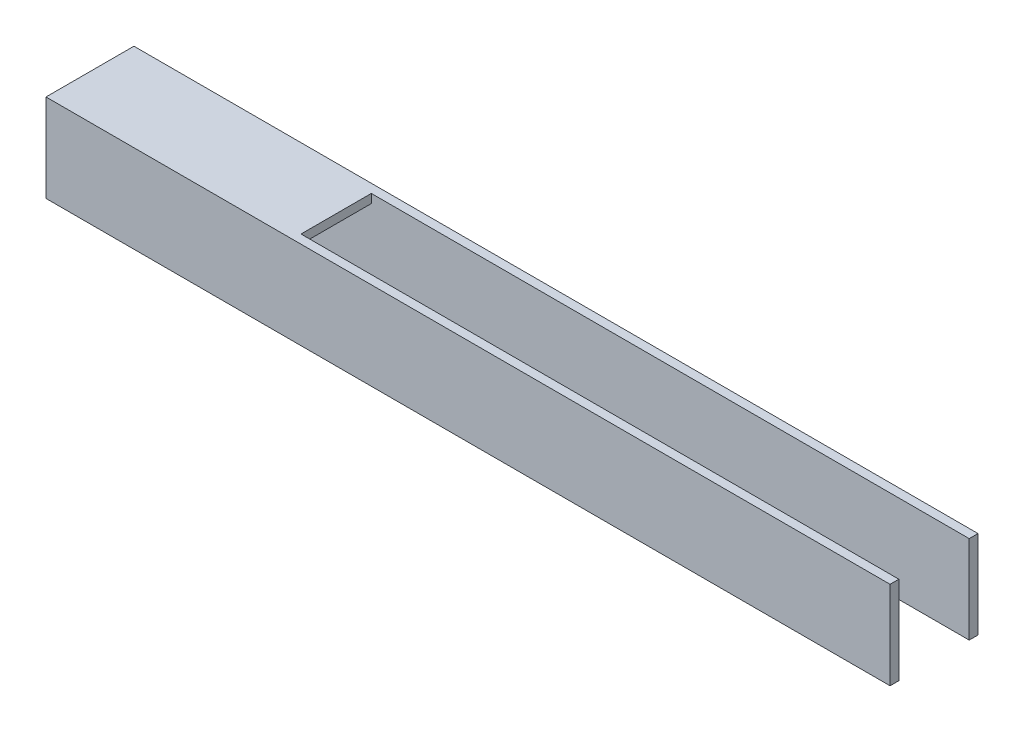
ISO-10303-21;
HEADER;
FILE_DESCRIPTION(('STEP AP214'),'2;1');
FILE_NAME('part.step','',(''),(''),'','','');
FILE_SCHEMA(('AUTOMOTIVE_DESIGN { 1 0 10303 214 1 1 1 1 }'));
ENDSEC;
DATA;
#1=APPLICATION_CONTEXT('core data for automotive mechanical design processes');
#2=APPLICATION_PROTOCOL_DEFINITION('international standard','automotive_design',2000,#1);
#3=PRODUCT_CONTEXT('',#1,'mechanical');
#4=PRODUCT('Part','Part','',(#3));
#5=PRODUCT_RELATED_PRODUCT_CATEGORY('part','',(#4));
#6=PRODUCT_DEFINITION_FORMATION('','',#4);
#7=PRODUCT_DEFINITION_CONTEXT('part definition',#1,'design');
#8=PRODUCT_DEFINITION('design','',#6,#7);
#9=PRODUCT_DEFINITION_SHAPE('','',#8);
#10=(LENGTH_UNIT() NAMED_UNIT(*) SI_UNIT(.MILLI.,.METRE.));
#11=(NAMED_UNIT(*) PLANE_ANGLE_UNIT() SI_UNIT($,.RADIAN.));
#12=(NAMED_UNIT(*) SI_UNIT($,.STERADIAN.) SOLID_ANGLE_UNIT());
#13=UNCERTAINTY_MEASURE_WITH_UNIT(LENGTH_MEASURE(1.E-05),#10,'distance_accuracy_value','');
#14=(GEOMETRIC_REPRESENTATION_CONTEXT(3) GLOBAL_UNCERTAINTY_ASSIGNED_CONTEXT((#13)) GLOBAL_UNIT_ASSIGNED_CONTEXT((#10,
#11,#12)) REPRESENTATION_CONTEXT('',''));
#15=CARTESIAN_POINT('',(0.,0.,0.));
#16=DIRECTION('',(0.,0.,1.));
#17=DIRECTION('',(1.,0.,0.));
#18=AXIS2_PLACEMENT_3D('',#15,#16,#17);
#19=CARTESIAN_POINT('',(304.8,3.175,15.875));
#20=DIRECTION('',(-1.,0.,0.));
#21=DIRECTION('',(0.,0.,1.));
#22=AXIS2_PLACEMENT_3D('',#19,#20,#21);
#23=PLANE('',#22);
#24=DIRECTION('',(0.,0.,1.));
#25=VECTOR('',#24,1.);
#26=CARTESIAN_POINT('',(304.8,3.175,15.875));
#27=LINE('',#26,#25);
#28=CARTESIAN_POINT('',(304.8,3.175,-15.875));
#29=VERTEX_POINT('',#28);
#30=CARTESIAN_POINT('',(304.8,3.17500000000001,-12.7));
#31=VERTEX_POINT('',#30);
#32=EDGE_CURVE('E129',#29,#31,#27,.T.);
#33=ORIENTED_EDGE('',*,*,#32,.T.);
#34=DIRECTION('',(0.,-1.,0.));
#35=VECTOR('',#34,1.);
#36=CARTESIAN_POINT('',(304.8,-28.575,-12.7));
#37=LINE('',#36,#35);
#38=CARTESIAN_POINT('',(304.8,-28.575,-12.7));
#39=VERTEX_POINT('',#38);
#40=EDGE_CURVE('E111',#31,#39,#37,.T.);
#41=ORIENTED_EDGE('',*,*,#40,.T.);
#42=DIRECTION('',(0.,0.,-1.));
#43=VECTOR('',#42,1.);
#44=CARTESIAN_POINT('',(304.8,-28.575,-15.875));
#45=LINE('',#44,#43);
#46=CARTESIAN_POINT('',(304.8,-28.575,-15.875));
#47=VERTEX_POINT('',#46);
#48=EDGE_CURVE('E104',#39,#47,#45,.T.);
#49=ORIENTED_EDGE('',*,*,#48,.T.);
#50=DIRECTION('',(0.,1.,0.));
#51=VECTOR('',#50,1.);
#52=CARTESIAN_POINT('',(304.8,3.175,-15.875));
#53=LINE('',#52,#51);
#54=EDGE_CURVE('E108',#47,#29,#53,.T.);
#55=ORIENTED_EDGE('',*,*,#54,.T.);
#56=EDGE_LOOP('',(#33,#41,#49,#55));
#57=FACE_BOUND('',#56,.T.);
#58=ADVANCED_FACE('F31',(#57),#23,.F.);
#59=CARTESIAN_POINT('',(304.8,-28.575,15.875));
#60=DIRECTION('',(0.,0.,-1.));
#61=DIRECTION('',(-1.,0.,0.));
#62=AXIS2_PLACEMENT_3D('',#59,#60,#61);
#63=PLANE('',#62);
#64=DIRECTION('',(0.,-1.,0.));
#65=VECTOR('',#64,1.);
#66=CARTESIAN_POINT('',(0.,-28.575,15.875));
#67=LINE('',#66,#65);
#68=CARTESIAN_POINT('',(0.,3.175,15.875));
#69=VERTEX_POINT('',#68);
#70=CARTESIAN_POINT('',(0.,-28.575,15.875));
#71=VERTEX_POINT('',#70);
#72=EDGE_CURVE('E134',#69,#71,#67,.T.);
#73=ORIENTED_EDGE('',*,*,#72,.T.);
#74=DIRECTION('',(-1.,0.,0.));
#75=VECTOR('',#74,1.);
#76=CARTESIAN_POINT('',(304.8,-28.575,15.875));
#77=LINE('',#76,#75);
#78=CARTESIAN_POINT('',(304.8,-28.575,15.875));
#79=VERTEX_POINT('',#78);
#80=EDGE_CURVE('E11',#79,#71,#77,.T.);
#81=ORIENTED_EDGE('',*,*,#80,.F.);
#82=DIRECTION('',(0.,-1.,0.));
#83=VECTOR('',#82,1.);
#84=CARTESIAN_POINT('',(304.8,-28.575,15.875));
#85=LINE('',#84,#83);
#86=CARTESIAN_POINT('',(304.8,3.175,15.875));
#87=VERTEX_POINT('',#86);
#88=EDGE_CURVE('E152',#87,#79,#85,.T.);
#89=ORIENTED_EDGE('',*,*,#88,.F.);
#90=DIRECTION('',(-1.,0.,0.));
#91=VECTOR('',#90,1.);
#92=CARTESIAN_POINT('',(304.8,3.175,15.875));
#93=LINE('',#92,#91);
#94=EDGE_CURVE('E133',#87,#69,#93,.T.);
#95=ORIENTED_EDGE('',*,*,#94,.T.);
#96=EDGE_LOOP('',(#73,#81,#89,#95));
#97=FACE_BOUND('',#96,.T.);
#98=ADVANCED_FACE('F33',(#97),#63,.F.);
#99=CARTESIAN_POINT('',(304.8,-28.575,12.7));
#100=DIRECTION('',(0.,1.,0.));
#101=DIRECTION('',(0.,0.,1.));
#102=AXIS2_PLACEMENT_3D('',#99,#100,#101);
#103=PLANE('',#102);
#104=DIRECTION('',(0.,0.,-1.));
#105=VECTOR('',#104,1.);
#106=CARTESIAN_POINT('',(0.,-28.575,12.7));
#107=LINE('',#106,#105);
#108=CARTESIAN_POINT('',(0.,-28.575,12.7));
#109=VERTEX_POINT('',#108);
#110=EDGE_CURVE('E137',#71,#109,#107,.T.);
#111=ORIENTED_EDGE('',*,*,#110,.T.);
#112=DIRECTION('',(-1.,0.,0.));
#113=VECTOR('',#112,1.);
#114=CARTESIAN_POINT('',(304.8,-28.575,12.7));
#115=LINE('',#114,#113);
#116=CARTESIAN_POINT('',(304.8,-28.575,12.7));
#117=VERTEX_POINT('',#116);
#118=EDGE_CURVE('E39',#117,#109,#115,.T.);
#119=ORIENTED_EDGE('',*,*,#118,.F.);
#120=DIRECTION('',(0.,0.,-1.));
#121=VECTOR('',#120,1.);
#122=CARTESIAN_POINT('',(304.8,-28.575,12.7));
#123=LINE('',#122,#121);
#124=EDGE_CURVE('E93',#79,#117,#123,.T.);
#125=ORIENTED_EDGE('',*,*,#124,.F.);
#126=ORIENTED_EDGE('',*,*,#80,.T.);
#127=EDGE_LOOP('',(#111,#119,#125,#126));
#128=FACE_BOUND('',#127,.T.);
#129=ADVANCED_FACE('F212',(#128),#103,.F.);
#130=CARTESIAN_POINT('',(304.8,0.,12.7));
#131=DIRECTION('',(0.,0.,1.));
#132=DIRECTION('',(0.,-1.,0.));
#133=AXIS2_PLACEMENT_3D('',#130,#131,#132);
#134=PLANE('',#133);
#135=DIRECTION('',(0.,1.,0.));
#136=VECTOR('',#135,1.);
#137=CARTESIAN_POINT('',(0.,0.,12.7));
#138=LINE('',#137,#136);
#139=CARTESIAN_POINT('',(0.,0.,12.7));
#140=VERTEX_POINT('',#139);
#141=EDGE_CURVE('E140',#109,#140,#138,.T.);
#142=ORIENTED_EDGE('',*,*,#141,.T.);
#143=DIRECTION('',(-1.,0.,0.));
#144=VECTOR('',#143,1.);
#145=CARTESIAN_POINT('',(304.8,0.,12.7));
#146=LINE('',#145,#144);
#147=CARTESIAN_POINT('',(88.9,0.,12.7));
#148=VERTEX_POINT('',#147);
#149=EDGE_CURVE('E158',#148,#140,#146,.T.);
#150=ORIENTED_EDGE('',*,*,#149,.F.);
#151=DIRECTION('',(0.,-1.,0.));
#152=VECTOR('',#151,1.);
#153=CARTESIAN_POINT('',(88.9,3.175,12.7));
#154=LINE('',#153,#152);
#155=CARTESIAN_POINT('',(88.9,3.175,12.7));
#156=VERTEX_POINT('',#155);
#157=EDGE_CURVE('E179',#156,#148,#154,.T.);
#158=ORIENTED_EDGE('',*,*,#157,.F.);
#159=DIRECTION('',(-1.,0.,0.));
#160=VECTOR('',#159,1.);
#161=CARTESIAN_POINT('',(304.8,3.175,12.7));
#162=LINE('',#161,#160);
#163=CARTESIAN_POINT('',(304.8,3.175,12.7));
#164=VERTEX_POINT('',#163);
#165=EDGE_CURVE('E200',#164,#156,#162,.T.);
#166=ORIENTED_EDGE('',*,*,#165,.F.);
#167=DIRECTION('',(0.,1.,0.));
#168=VECTOR('',#167,1.);
#169=CARTESIAN_POINT('',(304.8,0.,12.7));
#170=LINE('',#169,#168);
#171=EDGE_CURVE('E46',#117,#164,#170,.T.);
#172=ORIENTED_EDGE('',*,*,#171,.F.);
#173=ORIENTED_EDGE('',*,*,#118,.T.);
#174=EDGE_LOOP('',(#142,#150,#158,#166,#172,#173));
#175=FACE_BOUND('',#174,.T.);
#176=ADVANCED_FACE('F162',(#175),#134,.F.);
#177=CARTESIAN_POINT('',(304.8,0.,-12.7));
#178=DIRECTION('',(0.,1.,0.));
#179=DIRECTION('',(0.,0.,1.));
#180=AXIS2_PLACEMENT_3D('',#177,#178,#179);
#181=PLANE('',#180);
#182=DIRECTION('',(-1.,0.,0.));
#183=VECTOR('',#182,1.);
#184=CARTESIAN_POINT('',(304.8,0.,-12.7));
#185=LINE('',#184,#183);
#186=CARTESIAN_POINT('',(88.9,0.,-12.7));
#187=VERTEX_POINT('',#186);
#188=CARTESIAN_POINT('',(0.,0.,-12.7));
#189=VERTEX_POINT('',#188);
#190=EDGE_CURVE('E156',#187,#189,#185,.T.);
#191=ORIENTED_EDGE('',*,*,#190,.F.);
#192=DIRECTION('',(0.,0.,-1.));
#193=VECTOR('',#192,1.);
#194=CARTESIAN_POINT('',(88.9,0.,-12.7));
#195=LINE('',#194,#193);
#196=EDGE_CURVE('E175',#148,#187,#195,.T.);
#197=ORIENTED_EDGE('',*,*,#196,.F.);
#198=ORIENTED_EDGE('',*,*,#149,.T.);
#199=DIRECTION('',(0.,0.,-1.));
#200=VECTOR('',#199,1.);
#201=CARTESIAN_POINT('',(0.,0.,-12.7));
#202=LINE('',#201,#200);
#203=EDGE_CURVE('E143',#140,#189,#202,.T.);
#204=ORIENTED_EDGE('',*,*,#203,.T.);
#205=EDGE_LOOP('',(#191,#197,#198,#204));
#206=FACE_BOUND('',#205,.T.);
#207=ADVANCED_FACE('F171',(#206),#181,.F.);
#208=CARTESIAN_POINT('',(304.8,-28.575,-12.7));
#209=DIRECTION('',(0.,0.,-1.));
#210=DIRECTION('',(0.,1.,0.));
#211=AXIS2_PLACEMENT_3D('',#208,#209,#210);
#212=PLANE('',#211);
#213=DIRECTION('',(0.,-1.,0.));
#214=VECTOR('',#213,1.);
#215=CARTESIAN_POINT('',(0.,-28.575,-12.7));
#216=LINE('',#215,#214);
#217=CARTESIAN_POINT('',(0.,-28.575,-12.7));
#218=VERTEX_POINT('',#217);
#219=EDGE_CURVE('E146',#189,#218,#216,.T.);
#220=ORIENTED_EDGE('',*,*,#219,.T.);
#221=DIRECTION('',(-1.,0.,0.));
#222=VECTOR('',#221,1.);
#223=CARTESIAN_POINT('',(304.8,-28.575,-12.7));
#224=LINE('',#223,#222);
#225=EDGE_CURVE('E123',#39,#218,#224,.T.);
#226=ORIENTED_EDGE('',*,*,#225,.F.);
#227=ORIENTED_EDGE('',*,*,#40,.F.);
#228=DIRECTION('',(1.,0.,0.));
#229=VECTOR('',#228,1.);
#230=CARTESIAN_POINT('',(304.8,3.17500000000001,-12.7));
#231=LINE('',#230,#229);
#232=CARTESIAN_POINT('',(88.9,3.17500000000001,-12.7));
#233=VERTEX_POINT('',#232);
#234=EDGE_CURVE('E196',#233,#31,#231,.T.);
#235=ORIENTED_EDGE('',*,*,#234,.F.);
#236=DIRECTION('',(0.,-1.,0.));
#237=VECTOR('',#236,1.);
#238=CARTESIAN_POINT('',(88.9,3.17500000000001,-12.7));
#239=LINE('',#238,#237);
#240=EDGE_CURVE('E138',#233,#187,#239,.T.);
#241=ORIENTED_EDGE('',*,*,#240,.T.);
#242=ORIENTED_EDGE('',*,*,#190,.T.);
#243=EDGE_LOOP('',(#220,#226,#227,#235,#241,#242));
#244=FACE_BOUND('',#243,.T.);
#245=ADVANCED_FACE('F197',(#244),#212,.F.);
#246=CARTESIAN_POINT('',(304.8,-28.575,-15.875));
#247=DIRECTION('',(0.,1.,0.));
#248=DIRECTION('',(0.,0.,1.));
#249=AXIS2_PLACEMENT_3D('',#246,#247,#248);
#250=PLANE('',#249);
#251=DIRECTION('',(0.,0.,-1.));
#252=VECTOR('',#251,1.);
#253=CARTESIAN_POINT('',(0.,-28.575,-15.875));
#254=LINE('',#253,#252);
#255=CARTESIAN_POINT('',(0.,-28.575,-15.875));
#256=VERTEX_POINT('',#255);
#257=EDGE_CURVE('E120',#218,#256,#254,.T.);
#258=ORIENTED_EDGE('',*,*,#257,.T.);
#259=DIRECTION('',(-1.,0.,0.));
#260=VECTOR('',#259,1.);
#261=CARTESIAN_POINT('',(304.8,-28.575,-15.875));
#262=LINE('',#261,#260);
#263=EDGE_CURVE('E117',#47,#256,#262,.T.);
#264=ORIENTED_EDGE('',*,*,#263,.F.);
#265=ORIENTED_EDGE('',*,*,#48,.F.);
#266=ORIENTED_EDGE('',*,*,#225,.T.);
#267=EDGE_LOOP('',(#258,#264,#265,#266));
#268=FACE_BOUND('',#267,.T.);
#269=ADVANCED_FACE('F118',(#268),#250,.F.);
#270=CARTESIAN_POINT('',(304.8,3.175,-15.875));
#271=DIRECTION('',(0.,0.,1.));
#272=DIRECTION('',(1.,0.,0.));
#273=AXIS2_PLACEMENT_3D('',#270,#271,#272);
#274=PLANE('',#273);
#275=DIRECTION('',(0.,1.,0.));
#276=VECTOR('',#275,1.);
#277=CARTESIAN_POINT('',(0.,3.175,-15.875));
#278=LINE('',#277,#276);
#279=CARTESIAN_POINT('',(0.,3.175,-15.875));
#280=VERTEX_POINT('',#279);
#281=EDGE_CURVE('E149',#256,#280,#278,.T.);
#282=ORIENTED_EDGE('',*,*,#281,.T.);
#283=DIRECTION('',(-1.,0.,0.));
#284=VECTOR('',#283,1.);
#285=CARTESIAN_POINT('',(304.8,3.175,-15.875));
#286=LINE('',#285,#284);
#287=EDGE_CURVE('E124',#29,#280,#286,.T.);
#288=ORIENTED_EDGE('',*,*,#287,.F.);
#289=ORIENTED_EDGE('',*,*,#54,.F.);
#290=ORIENTED_EDGE('',*,*,#263,.T.);
#291=EDGE_LOOP('',(#282,#288,#289,#290));
#292=FACE_BOUND('',#291,.T.);
#293=ADVANCED_FACE('F126',(#292),#274,.F.);
#294=CARTESIAN_POINT('',(304.8,3.175,15.875));
#295=DIRECTION('',(0.,-1.,0.));
#296=DIRECTION('',(0.,0.,-1.));
#297=AXIS2_PLACEMENT_3D('',#294,#295,#296);
#298=PLANE('',#297);
#299=DIRECTION('',(0.,0.,-1.));
#300=VECTOR('',#299,1.);
#301=CARTESIAN_POINT('',(88.9,3.17500000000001,-12.7));
#302=LINE('',#301,#300);
#303=EDGE_CURVE('E191',#156,#233,#302,.T.);
#304=ORIENTED_EDGE('',*,*,#303,.T.);
#305=ORIENTED_EDGE('',*,*,#234,.T.);
#306=ORIENTED_EDGE('',*,*,#32,.F.);
#307=ORIENTED_EDGE('',*,*,#287,.T.);
#308=DIRECTION('',(0.,0.,1.));
#309=VECTOR('',#308,1.);
#310=CARTESIAN_POINT('',(0.,3.175,15.875));
#311=LINE('',#310,#309);
#312=EDGE_CURVE('E86',#280,#69,#311,.T.);
#313=ORIENTED_EDGE('',*,*,#312,.T.);
#314=ORIENTED_EDGE('',*,*,#94,.F.);
#315=EDGE_CURVE('E52',#164,#87,#27,.T.);
#316=ORIENTED_EDGE('',*,*,#315,.F.);
#317=ORIENTED_EDGE('',*,*,#165,.T.);
#318=EDGE_LOOP('',(#304,#305,#306,#307,#313,#314,#316,#317));
#319=FACE_BOUND('',#318,.T.);
#320=ADVANCED_FACE('F199',(#319),#298,.F.);
#321=ORIENTED_EDGE('',*,*,#171,.T.);
#322=ORIENTED_EDGE('',*,*,#315,.T.);
#323=ORIENTED_EDGE('',*,*,#88,.T.);
#324=ORIENTED_EDGE('',*,*,#124,.T.);
#325=EDGE_LOOP('',(#321,#322,#323,#324));
#326=FACE_BOUND('',#325,.T.);
#327=ADVANCED_FACE('F208',(#326),#23,.F.);
#328=CARTESIAN_POINT('',(0.,3.175,15.875));
#329=DIRECTION('',(-1.,0.,0.));
#330=DIRECTION('',(0.,0.,1.));
#331=AXIS2_PLACEMENT_3D('',#328,#329,#330);
#332=PLANE('',#331);
#333=ORIENTED_EDGE('',*,*,#72,.F.);
#334=ORIENTED_EDGE('',*,*,#312,.F.);
#335=ORIENTED_EDGE('',*,*,#281,.F.);
#336=ORIENTED_EDGE('',*,*,#257,.F.);
#337=ORIENTED_EDGE('',*,*,#219,.F.);
#338=ORIENTED_EDGE('',*,*,#203,.F.);
#339=ORIENTED_EDGE('',*,*,#141,.F.);
#340=ORIENTED_EDGE('',*,*,#110,.F.);
#341=EDGE_LOOP('',(#333,#334,#335,#336,#337,#338,#339,#340));
#342=FACE_BOUND('',#341,.T.);
#343=ADVANCED_FACE('F167',(#342),#332,.T.);
#344=CARTESIAN_POINT('',(88.9,3.17500000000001,-12.7));
#345=DIRECTION('',(-1.,0.,0.));
#346=DIRECTION('',(0.,0.,1.));
#347=AXIS2_PLACEMENT_3D('',#344,#345,#346);
#348=PLANE('',#347);
#349=ORIENTED_EDGE('',*,*,#196,.T.);
#350=ORIENTED_EDGE('',*,*,#240,.F.);
#351=ORIENTED_EDGE('',*,*,#303,.F.);
#352=ORIENTED_EDGE('',*,*,#157,.T.);
#353=EDGE_LOOP('',(#349,#350,#351,#352));
#354=FACE_BOUND('',#353,.T.);
#355=ADVANCED_FACE('F189',(#354),#348,.F.);
#356=CLOSED_SHELL('',(#58,#98,#129,#176,#207,#245,#269,#293,#320,#327,#343,#355));
#357=MANIFOLD_SOLID_BREP('B2',#356);
#358=ADVANCED_BREP_SHAPE_REPRESENTATION('',(#18,#357),#14);
#359=SHAPE_DEFINITION_REPRESENTATION(#9,#358);
ENDSEC;
END-ISO-10303-21;
